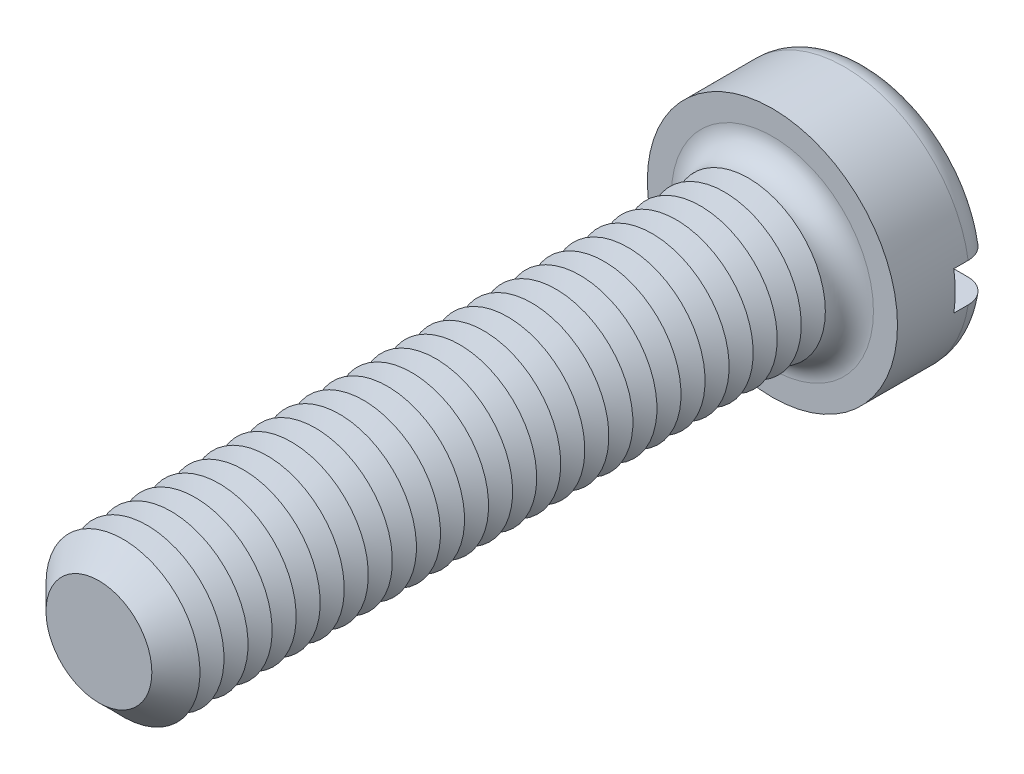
from build123d import *

# Parameters (mm, degrees)
SKETCH3_R           = 6.5
BOSS_EXTRUDE2_DEPTH = 5
SKETCH4_R           = 4
BOSS_EXTRUDE3_DEPTH = 35
FILLET1_R           = 1.25
CHAMFER1_SIZE       = 1.25
LPATTERN1_COUNT     = 26
LPATTERN1_PITCH     = 1.25
SKETCH8_W           = 13
SKETCH8_H           = 2
CUT_EXTRUDE1_DEPTH  = 2


with BuildPart() as part:
    # Sketch3 → Boss-Extrude2 (new body)
    with BuildSketch(Plane.XY):
        Circle(SKETCH3_R)
    extrude(amount=-BOSS_EXTRUDE2_DEPTH)

    # Sketch4 → Boss-Extrude3 (add)
    with BuildSketch(Plane.XY):
        Circle(SKETCH4_R)
    extrude(amount=BOSS_EXTRUDE3_DEPTH)

    # Fillet1
    fillet1_edges = [part.edges().sort_by_distance(p)[0] for p in [
        (-6.5, 0, -5),
        (-4, 0, 0),
    ]]
    fillet(fillet1_edges, radius=FILLET1_R)

    # Chamfer1
    chamfer1_edges = [part.edges().sort_by_distance(p)[0] for p in [
        (-4, 0, 35),
    ]]
    chamfer(chamfer1_edges, length=CHAMFER1_SIZE)

    # Sketch6 → Cut-Revolve1 (revolve, cut)
    with BuildSketch(Plane(origin=(0, 0, 0), x_dir=(0, 0, -1), z_dir=(1, 0, 0)), mode=Mode.PRIVATE) as cut_revolve1_sk:
        Polygon((-1.25, 4), (-1.875, 2.917468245), (-2.5, 4), align=None)
    cut_revolve1 = revolve(cut_revolve1_sk.sketch.rotate(Axis((0, 0, -1.694361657), (0, 0, 1)), 90), axis=Axis((0, 0, -1.694361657), (0, 0, 1)), mode=Mode.SUBTRACT)

    # LPattern1: Cut-Revolve1 ×26
    with Locations(*[(0, 0, i * LPATTERN1_PITCH) for i in range(1, LPATTERN1_COUNT)]):
        add(cut_revolve1, mode=Mode.SUBTRACT)

    # Sketch8 → Cut-Extrude1 (cut)
    with BuildSketch(Plane(origin=(0, 0, -5), x_dir=(-1, 0, 0), z_dir=(0, 0, -1))):
        Rectangle(SKETCH8_W, SKETCH8_H)
    extrude(amount=-CUT_EXTRUDE1_DEPTH, mode=Mode.SUBTRACT)


solid = part.part
